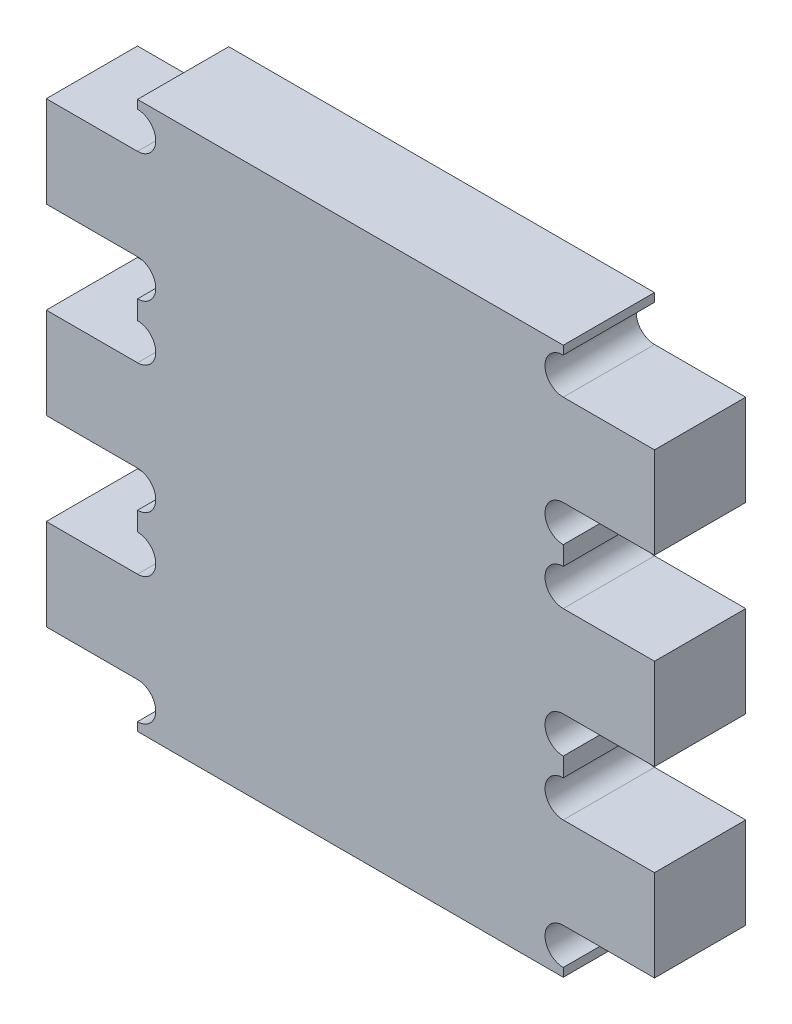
from build123d import *

# Parameters (mm, degrees)
OUTLINE_DEPTH = 15


with BuildPart() as part:
    # Skizze1 → outline (new body)
    with BuildSketch(Plane.XY):
        with BuildLine():
            Line((15, 90), (15, 88.6))
            ThreePointArc((15, 88.6), (18, 85.6), (15, 82.6))
            Line((15, 82.6), (0, 82.6))
            Line((0, 82.6), (0, 67.6))
            Line((0, 67.6), (15, 67.6))
            ThreePointArc((15, 67.6), (18, 64.6), (15, 61.6))
            Line((15, 61.6), (15, 58.5))
            ThreePointArc((15, 58.5), (18, 55.5), (15, 52.5))
            Line((15, 52.5), (0, 52.5))
            Line((0, 52.5), (0, 37.5))
            Line((0, 37.5), (15, 37.5))
            ThreePointArc((15, 37.5), (18, 34.5), (15, 31.5))
            Line((15, 31.5), (15, 28.4))
            ThreePointArc((15, 28.4), (18, 25.4), (15, 22.4))
            Line((15, 22.4), (0, 22.4))
            Line((0, 22.4), (0, 7.4))
            Line((0, 7.4), (15, 7.4))
            ThreePointArc((15, 7.4), (18, 4.4), (15, 1.4))
            Line((15, 1.4), (15, 0))
            Line((15, 0), (85, 0))
            Line((85, 0), (85, 1.4))
            ThreePointArc((85, 1.4), (82, 4.4), (85, 7.4))
            Line((85, 7.4), (100, 7.4))
            Line((100, 7.4), (100, 22.4))
            Line((100, 22.4), (85, 22.4))
            ThreePointArc((85, 22.4), (82, 25.4), (85, 28.4))
            Line((85, 28.4), (85, 31.5))
            ThreePointArc((85, 31.5), (82, 34.5), (85, 37.5))
            Line((85, 37.5), (100, 37.5))
            Line((100, 37.5), (100, 52.5))
            Line((100, 52.5), (85, 52.5))
            ThreePointArc((85, 52.5), (82, 55.5), (85, 58.5))
            Line((85, 58.5), (85, 61.6))
            ThreePointArc((85, 61.6), (82, 64.6), (85, 67.6))
            Line((85, 67.6), (100, 67.6))
            Line((100, 67.6), (100, 82.6))
            Line((100, 82.6), (85, 82.6))
            ThreePointArc((85, 82.6), (82, 85.6), (85, 88.6))
            Line((85, 88.6), (85, 90))
            Line((85, 90), (15, 90))
        make_face()
    extrude(amount=OUTLINE_DEPTH)


solid = part.part
